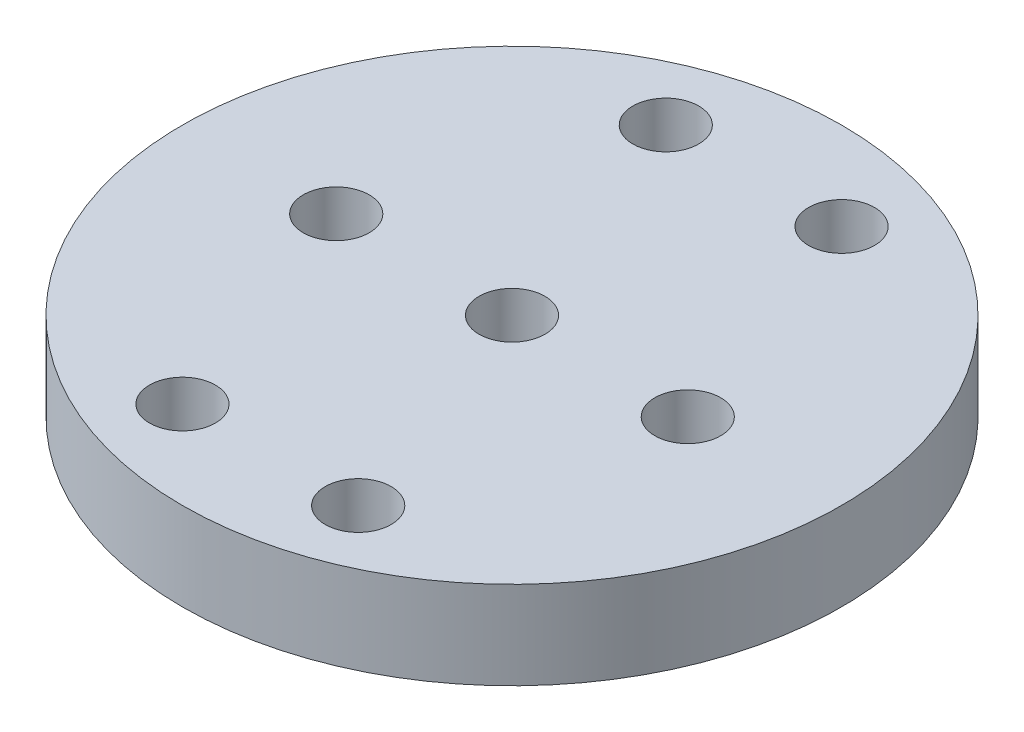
ISO-10303-21;
HEADER;
FILE_DESCRIPTION(('STEP AP214'),'2;1');
FILE_NAME('part.step','',(''),(''),'','','');
FILE_SCHEMA(('AUTOMOTIVE_DESIGN { 1 0 10303 214 1 1 1 1 }'));
ENDSEC;
DATA;
#1=APPLICATION_CONTEXT('core data for automotive mechanical design processes');
#2=APPLICATION_PROTOCOL_DEFINITION('international standard','automotive_design',2000,#1);
#3=PRODUCT_CONTEXT('',#1,'mechanical');
#4=PRODUCT('Part','Part','',(#3));
#5=PRODUCT_RELATED_PRODUCT_CATEGORY('part','',(#4));
#6=PRODUCT_DEFINITION_FORMATION('','',#4);
#7=PRODUCT_DEFINITION_CONTEXT('part definition',#1,'design');
#8=PRODUCT_DEFINITION('design','',#6,#7);
#9=PRODUCT_DEFINITION_SHAPE('','',#8);
#10=(LENGTH_UNIT() NAMED_UNIT(*) SI_UNIT(.MILLI.,.METRE.));
#11=(NAMED_UNIT(*) PLANE_ANGLE_UNIT() SI_UNIT($,.RADIAN.));
#12=(NAMED_UNIT(*) SI_UNIT($,.STERADIAN.) SOLID_ANGLE_UNIT());
#13=UNCERTAINTY_MEASURE_WITH_UNIT(LENGTH_MEASURE(1.E-05),#10,'distance_accuracy_value','');
#14=(GEOMETRIC_REPRESENTATION_CONTEXT(3) GLOBAL_UNCERTAINTY_ASSIGNED_CONTEXT((#13)) GLOBAL_UNIT_ASSIGNED_CONTEXT((#10,
#11,#12)) REPRESENTATION_CONTEXT('',''));
#15=CARTESIAN_POINT('',(0.,0.,0.));
#16=DIRECTION('',(0.,0.,1.));
#17=DIRECTION('',(1.,0.,0.));
#18=AXIS2_PLACEMENT_3D('',#15,#16,#17);
#19=CARTESIAN_POINT('',(0.,20.,0.));
#20=DIRECTION('',(0.,-1.,0.));
#21=DIRECTION('',(0.,0.,-1.));
#22=AXIS2_PLACEMENT_3D('',#19,#20,#21);
#23=CYLINDRICAL_SURFACE('',#22,75.);
#24=CARTESIAN_POINT('',(0.,20.,0.));
#25=DIRECTION('',(0.,1.,0.));
#26=DIRECTION('',(0.,0.,1.));
#27=AXIS2_PLACEMENT_3D('',#24,#25,#26);
#28=CIRCLE('',#27,75.);
#29=CARTESIAN_POINT('',(0.,20.,75.));
#30=VERTEX_POINT('',#29);
#31=EDGE_CURVE('E10',#30,#30,#28,.T.);
#32=ORIENTED_EDGE('',*,*,#31,.F.);
#33=EDGE_LOOP('',(#32));
#34=FACE_BOUND('',#33,.T.);
#35=CARTESIAN_POINT('',(0.,0.,0.));
#36=DIRECTION('',(0.,1.,0.));
#37=DIRECTION('',(0.,0.,1.));
#38=AXIS2_PLACEMENT_3D('',#35,#36,#37);
#39=CIRCLE('',#38,75.);
#40=CARTESIAN_POINT('',(0.,0.,75.));
#41=VERTEX_POINT('',#40);
#42=EDGE_CURVE('E40',#41,#41,#39,.T.);
#43=ORIENTED_EDGE('',*,*,#42,.T.);
#44=EDGE_LOOP('',(#43));
#45=FACE_BOUND('',#44,.T.);
#46=ADVANCED_FACE('F34',(#34,#45),#23,.T.);
#47=CARTESIAN_POINT('',(0.,20.,0.));
#48=DIRECTION('',(0.,1.,0.));
#49=DIRECTION('',(0.,0.,1.));
#50=AXIS2_PLACEMENT_3D('',#47,#48,#49);
#51=PLANE('',#50);
#52=CARTESIAN_POINT('',(20.,20.,55.));
#53=DIRECTION('',(0.,1.,0.));
#54=DIRECTION('',(0.,0.,1.));
#55=AXIS2_PLACEMENT_3D('',#52,#53,#54);
#56=CIRCLE('',#55,7.5);
#57=CARTESIAN_POINT('',(20.,20.,62.5));
#58=VERTEX_POINT('',#57);
#59=EDGE_CURVE('E84',#58,#58,#56,.T.);
#60=ORIENTED_EDGE('',*,*,#59,.F.);
#61=EDGE_LOOP('',(#60));
#62=FACE_BOUND('',#61,.T.);
#63=CARTESIAN_POINT('',(20.,20.,-55.));
#64=DIRECTION('',(0.,1.,0.));
#65=DIRECTION('',(0.,0.,1.));
#66=AXIS2_PLACEMENT_3D('',#63,#64,#65);
#67=CIRCLE('',#66,7.5);
#68=CARTESIAN_POINT('',(20.,20.,-47.5));
#69=VERTEX_POINT('',#68);
#70=EDGE_CURVE('E78',#69,#69,#67,.T.);
#71=ORIENTED_EDGE('',*,*,#70,.F.);
#72=EDGE_LOOP('',(#71));
#73=FACE_BOUND('',#72,.T.);
#74=CARTESIAN_POINT('',(40.,20.,0.));
#75=DIRECTION('',(0.,1.,0.));
#76=DIRECTION('',(0.,0.,1.));
#77=AXIS2_PLACEMENT_3D('',#74,#75,#76);
#78=CIRCLE('',#77,7.5);
#79=CARTESIAN_POINT('',(40.,20.,7.5));
#80=VERTEX_POINT('',#79);
#81=EDGE_CURVE('E72',#80,#80,#78,.T.);
#82=ORIENTED_EDGE('',*,*,#81,.F.);
#83=EDGE_LOOP('',(#82));
#84=FACE_BOUND('',#83,.T.);
#85=CARTESIAN_POINT('',(-20.,20.,55.));
#86=DIRECTION('',(0.,1.,0.));
#87=DIRECTION('',(0.,0.,1.));
#88=AXIS2_PLACEMENT_3D('',#85,#86,#87);
#89=CIRCLE('',#88,7.5);
#90=CARTESIAN_POINT('',(-20.,20.,62.5));
#91=VERTEX_POINT('',#90);
#92=EDGE_CURVE('E66',#91,#91,#89,.T.);
#93=ORIENTED_EDGE('',*,*,#92,.F.);
#94=EDGE_LOOP('',(#93));
#95=FACE_BOUND('',#94,.T.);
#96=CARTESIAN_POINT('',(-40.,20.,0.));
#97=DIRECTION('',(0.,1.,0.));
#98=DIRECTION('',(0.,0.,1.));
#99=AXIS2_PLACEMENT_3D('',#96,#97,#98);
#100=CIRCLE('',#99,7.5);
#101=CARTESIAN_POINT('',(-40.,20.,7.5));
#102=VERTEX_POINT('',#101);
#103=EDGE_CURVE('E60',#102,#102,#100,.T.);
#104=ORIENTED_EDGE('',*,*,#103,.F.);
#105=EDGE_LOOP('',(#104));
#106=FACE_BOUND('',#105,.T.);
#107=CARTESIAN_POINT('',(-20.,20.,-55.));
#108=DIRECTION('',(0.,1.,0.));
#109=DIRECTION('',(0.,0.,1.));
#110=AXIS2_PLACEMENT_3D('',#107,#108,#109);
#111=CIRCLE('',#110,7.5);
#112=CARTESIAN_POINT('',(-20.,20.,-47.5));
#113=VERTEX_POINT('',#112);
#114=EDGE_CURVE('E54',#113,#113,#111,.T.);
#115=ORIENTED_EDGE('',*,*,#114,.F.);
#116=EDGE_LOOP('',(#115));
#117=FACE_BOUND('',#116,.T.);
#118=CARTESIAN_POINT('',(0.,20.,0.));
#119=DIRECTION('',(0.,1.,0.));
#120=DIRECTION('',(0.,0.,1.));
#121=AXIS2_PLACEMENT_3D('',#118,#119,#120);
#122=CIRCLE('',#121,7.5);
#123=CARTESIAN_POINT('',(0.,20.,7.5));
#124=VERTEX_POINT('',#123);
#125=EDGE_CURVE('E48',#124,#124,#122,.T.);
#126=ORIENTED_EDGE('',*,*,#125,.F.);
#127=EDGE_LOOP('',(#126));
#128=FACE_BOUND('',#127,.T.);
#129=ORIENTED_EDGE('',*,*,#31,.T.);
#130=EDGE_LOOP('',(#129));
#131=FACE_BOUND('',#130,.T.);
#132=ADVANCED_FACE('F100',(#62,#73,#84,#95,#106,#117,#128,#131),#51,.T.);
#133=CARTESIAN_POINT('',(0.,0.,0.));
#134=DIRECTION('',(0.,1.,0.));
#135=DIRECTION('',(0.,0.,1.));
#136=AXIS2_PLACEMENT_3D('',#133,#134,#135);
#137=PLANE('',#136);
#138=CARTESIAN_POINT('',(20.,0.,55.));
#139=DIRECTION('',(0.,1.,0.));
#140=DIRECTION('',(0.,0.,1.));
#141=AXIS2_PLACEMENT_3D('',#138,#139,#140);
#142=CIRCLE('',#141,7.5);
#143=CARTESIAN_POINT('',(20.,0.,62.5));
#144=VERTEX_POINT('',#143);
#145=EDGE_CURVE('E81',#144,#144,#142,.T.);
#146=ORIENTED_EDGE('',*,*,#145,.T.);
#147=EDGE_LOOP('',(#146));
#148=FACE_BOUND('',#147,.T.);
#149=CARTESIAN_POINT('',(20.,0.,-55.));
#150=DIRECTION('',(0.,1.,0.));
#151=DIRECTION('',(0.,0.,1.));
#152=AXIS2_PLACEMENT_3D('',#149,#150,#151);
#153=CIRCLE('',#152,7.5);
#154=CARTESIAN_POINT('',(20.,0.,-47.5));
#155=VERTEX_POINT('',#154);
#156=EDGE_CURVE('E75',#155,#155,#153,.T.);
#157=ORIENTED_EDGE('',*,*,#156,.T.);
#158=EDGE_LOOP('',(#157));
#159=FACE_BOUND('',#158,.T.);
#160=CARTESIAN_POINT('',(40.,0.,0.));
#161=DIRECTION('',(0.,1.,0.));
#162=DIRECTION('',(0.,0.,1.));
#163=AXIS2_PLACEMENT_3D('',#160,#161,#162);
#164=CIRCLE('',#163,7.5);
#165=CARTESIAN_POINT('',(40.,0.,7.5));
#166=VERTEX_POINT('',#165);
#167=EDGE_CURVE('E69',#166,#166,#164,.T.);
#168=ORIENTED_EDGE('',*,*,#167,.T.);
#169=EDGE_LOOP('',(#168));
#170=FACE_BOUND('',#169,.T.);
#171=CARTESIAN_POINT('',(-20.,0.,55.));
#172=DIRECTION('',(0.,1.,0.));
#173=DIRECTION('',(0.,0.,1.));
#174=AXIS2_PLACEMENT_3D('',#171,#172,#173);
#175=CIRCLE('',#174,7.5);
#176=CARTESIAN_POINT('',(-20.,0.,62.5));
#177=VERTEX_POINT('',#176);
#178=EDGE_CURVE('E63',#177,#177,#175,.T.);
#179=ORIENTED_EDGE('',*,*,#178,.T.);
#180=EDGE_LOOP('',(#179));
#181=FACE_BOUND('',#180,.T.);
#182=CARTESIAN_POINT('',(-40.,0.,0.));
#183=DIRECTION('',(0.,1.,0.));
#184=DIRECTION('',(0.,0.,1.));
#185=AXIS2_PLACEMENT_3D('',#182,#183,#184);
#186=CIRCLE('',#185,7.5);
#187=CARTESIAN_POINT('',(-40.,0.,7.5));
#188=VERTEX_POINT('',#187);
#189=EDGE_CURVE('E57',#188,#188,#186,.T.);
#190=ORIENTED_EDGE('',*,*,#189,.T.);
#191=EDGE_LOOP('',(#190));
#192=FACE_BOUND('',#191,.T.);
#193=CARTESIAN_POINT('',(-20.,0.,-55.));
#194=DIRECTION('',(0.,1.,0.));
#195=DIRECTION('',(0.,0.,1.));
#196=AXIS2_PLACEMENT_3D('',#193,#194,#195);
#197=CIRCLE('',#196,7.5);
#198=CARTESIAN_POINT('',(-20.,0.,-47.5));
#199=VERTEX_POINT('',#198);
#200=EDGE_CURVE('E53',#199,#199,#197,.T.);
#201=ORIENTED_EDGE('',*,*,#200,.T.);
#202=EDGE_LOOP('',(#201));
#203=FACE_BOUND('',#202,.T.);
#204=CARTESIAN_POINT('',(0.,0.,0.));
#205=DIRECTION('',(0.,1.,0.));
#206=DIRECTION('',(0.,0.,1.));
#207=AXIS2_PLACEMENT_3D('',#204,#205,#206);
#208=CIRCLE('',#207,7.5);
#209=CARTESIAN_POINT('',(0.,0.,7.5));
#210=VERTEX_POINT('',#209);
#211=EDGE_CURVE('E44',#210,#210,#208,.T.);
#212=ORIENTED_EDGE('',*,*,#211,.T.);
#213=EDGE_LOOP('',(#212));
#214=FACE_BOUND('',#213,.T.);
#215=ORIENTED_EDGE('',*,*,#42,.F.);
#216=EDGE_LOOP('',(#215));
#217=FACE_BOUND('',#216,.T.);
#218=ADVANCED_FACE('F90',(#148,#159,#170,#181,#192,#203,#214,#217),#137,.F.);
#219=CARTESIAN_POINT('',(0.,0.,0.));
#220=DIRECTION('',(0.,1.,0.));
#221=DIRECTION('',(0.,0.,1.));
#222=AXIS2_PLACEMENT_3D('',#219,#220,#221);
#223=CYLINDRICAL_SURFACE('',#222,7.5);
#224=ORIENTED_EDGE('',*,*,#211,.F.);
#225=EDGE_LOOP('',(#224));
#226=FACE_BOUND('',#225,.T.);
#227=ORIENTED_EDGE('',*,*,#125,.T.);
#228=EDGE_LOOP('',(#227));
#229=FACE_BOUND('',#228,.T.);
#230=ADVANCED_FACE('F115',(#226,#229),#223,.F.);
#231=CARTESIAN_POINT('',(-20.,0.,-55.));
#232=DIRECTION('',(0.,1.,0.));
#233=DIRECTION('',(0.,0.,1.));
#234=AXIS2_PLACEMENT_3D('',#231,#232,#233);
#235=CYLINDRICAL_SURFACE('',#234,7.5);
#236=ORIENTED_EDGE('',*,*,#200,.F.);
#237=EDGE_LOOP('',(#236));
#238=FACE_BOUND('',#237,.T.);
#239=ORIENTED_EDGE('',*,*,#114,.T.);
#240=EDGE_LOOP('',(#239));
#241=FACE_BOUND('',#240,.T.);
#242=ADVANCED_FACE('F117',(#238,#241),#235,.F.);
#243=CARTESIAN_POINT('',(-40.,0.,0.));
#244=DIRECTION('',(0.,1.,0.));
#245=DIRECTION('',(0.,0.,1.));
#246=AXIS2_PLACEMENT_3D('',#243,#244,#245);
#247=CYLINDRICAL_SURFACE('',#246,7.5);
#248=ORIENTED_EDGE('',*,*,#189,.F.);
#249=EDGE_LOOP('',(#248));
#250=FACE_BOUND('',#249,.T.);
#251=ORIENTED_EDGE('',*,*,#103,.T.);
#252=EDGE_LOOP('',(#251));
#253=FACE_BOUND('',#252,.T.);
#254=ADVANCED_FACE('F124',(#250,#253),#247,.F.);
#255=CARTESIAN_POINT('',(-20.,0.,55.));
#256=DIRECTION('',(0.,1.,0.));
#257=DIRECTION('',(0.,0.,1.));
#258=AXIS2_PLACEMENT_3D('',#255,#256,#257);
#259=CYLINDRICAL_SURFACE('',#258,7.5);
#260=ORIENTED_EDGE('',*,*,#178,.F.);
#261=EDGE_LOOP('',(#260));
#262=FACE_BOUND('',#261,.T.);
#263=ORIENTED_EDGE('',*,*,#92,.T.);
#264=EDGE_LOOP('',(#263));
#265=FACE_BOUND('',#264,.T.);
#266=ADVANCED_FACE('F157',(#262,#265),#259,.F.);
#267=CARTESIAN_POINT('',(40.,0.,0.));
#268=DIRECTION('',(0.,1.,0.));
#269=DIRECTION('',(0.,0.,1.));
#270=AXIS2_PLACEMENT_3D('',#267,#268,#269);
#271=CYLINDRICAL_SURFACE('',#270,7.5);
#272=ORIENTED_EDGE('',*,*,#167,.F.);
#273=EDGE_LOOP('',(#272));
#274=FACE_BOUND('',#273,.T.);
#275=ORIENTED_EDGE('',*,*,#81,.T.);
#276=EDGE_LOOP('',(#275));
#277=FACE_BOUND('',#276,.T.);
#278=ADVANCED_FACE('F167',(#274,#277),#271,.F.);
#279=CARTESIAN_POINT('',(20.,0.,-55.));
#280=DIRECTION('',(0.,1.,0.));
#281=DIRECTION('',(0.,0.,1.));
#282=AXIS2_PLACEMENT_3D('',#279,#280,#281);
#283=CYLINDRICAL_SURFACE('',#282,7.5);
#284=ORIENTED_EDGE('',*,*,#156,.F.);
#285=EDGE_LOOP('',(#284));
#286=FACE_BOUND('',#285,.T.);
#287=ORIENTED_EDGE('',*,*,#70,.T.);
#288=EDGE_LOOP('',(#287));
#289=FACE_BOUND('',#288,.T.);
#290=ADVANCED_FACE('F96',(#286,#289),#283,.F.);
#291=CARTESIAN_POINT('',(20.,0.,55.));
#292=DIRECTION('',(0.,1.,0.));
#293=DIRECTION('',(0.,0.,1.));
#294=AXIS2_PLACEMENT_3D('',#291,#292,#293);
#295=CYLINDRICAL_SURFACE('',#294,7.5);
#296=ORIENTED_EDGE('',*,*,#145,.F.);
#297=EDGE_LOOP('',(#296));
#298=FACE_BOUND('',#297,.T.);
#299=ORIENTED_EDGE('',*,*,#59,.T.);
#300=EDGE_LOOP('',(#299));
#301=FACE_BOUND('',#300,.T.);
#302=ADVANCED_FACE('F93',(#298,#301),#295,.F.);
#303=CLOSED_SHELL('',(#46,#132,#218,#230,#242,#254,#266,#278,#290,#302));
#304=MANIFOLD_SOLID_BREP('B2',#303);
#305=ADVANCED_BREP_SHAPE_REPRESENTATION('',(#18,#304),#14);
#306=SHAPE_DEFINITION_REPRESENTATION(#9,#305);
ENDSEC;
END-ISO-10303-21;
